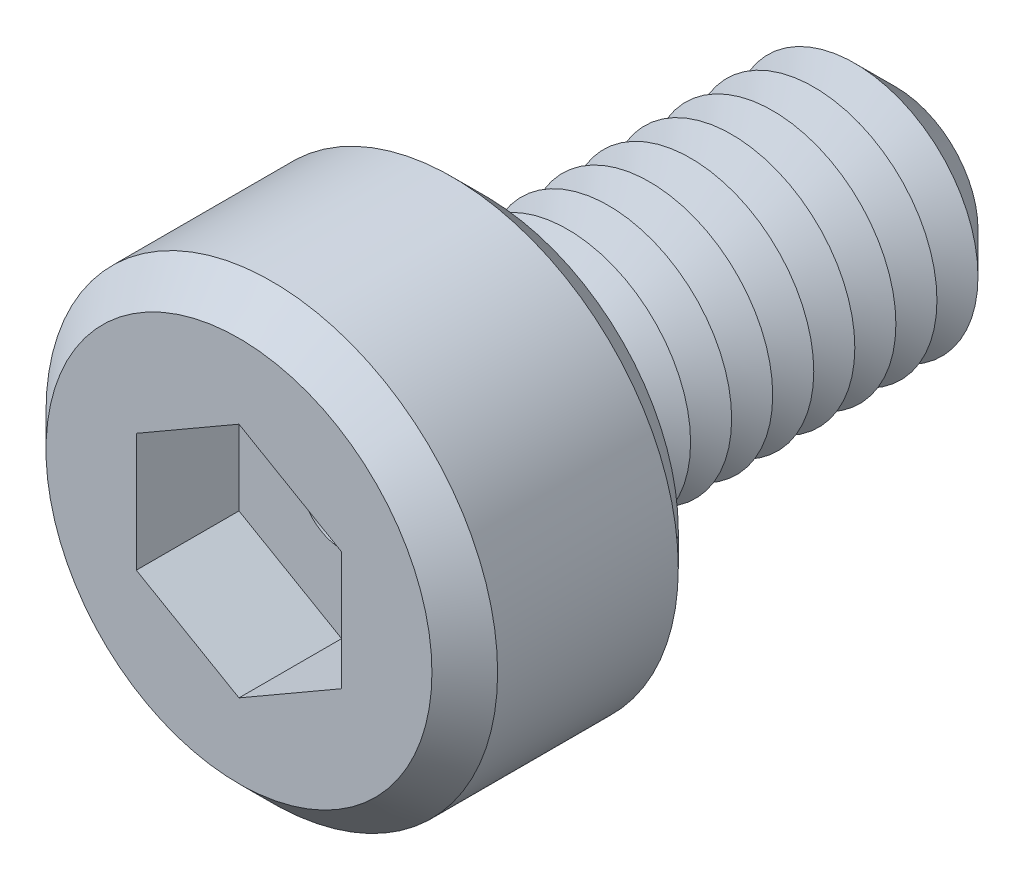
from build123d import *

# Parameters (mm, degrees)
SKETCH1_R           = 2.75
BOSS_EXTRUDE1_DEPTH = 3
SKETCH2_R           = 1.5
BOSS_EXTRUDE2_DEPTH = 5
CHAMFER1_SIZE       = 0.5
LPATTERN1_COUNT     = 9
LPATTERN1_PITCH     = 0.5
CUT_EXTRUDE1_DEPTH  = 1.25
SKETCH6_R           = 0.5
CUT_EXTRUDE2_DEPTH  = 6.75
CHAMFER2_SIZE       = 0.4


with BuildPart() as part:
    # Sketch1 → Boss-Extrude1 (new body)
    with BuildSketch(Plane.XY):
        Circle(SKETCH1_R)
    extrude(amount=BOSS_EXTRUDE1_DEPTH)

    # Sketch2 → Boss-Extrude2 (add)
    with BuildSketch(Plane(origin=(0, 0, 0), x_dir=(-1, 0, 0), z_dir=(0, 0, -1))):
        Circle(SKETCH2_R)
    extrude(amount=BOSS_EXTRUDE2_DEPTH)

    # Chamfer1
    chamfer1_edges = [part.edges().sort_by_distance(p)[0] for p in [
        (1.5, 0, -5),
    ]]
    chamfer(chamfer1_edges, length=CHAMFER1_SIZE)

    # Sketch4 → Cut-Revolve1 (revolve, cut)
    with BuildSketch(Plane(origin=(0, 0, 0), x_dir=(0, 0, -1), z_dir=(1, 0, 0)), mode=Mode.PRIVATE) as cut_revolve1_sk:
        Polygon((0, 1.5), (0.25, 1.066987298), (0.5, 1.5), align=None)
    cut_revolve1 = revolve(cut_revolve1_sk.sketch.rotate(Axis((0, 0, 2.512122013), (0, 0, -1)), 90), axis=Axis((0, 0, 2.512122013), (0, 0, -1)), mode=Mode.SUBTRACT)

    # LPattern1: Cut-Revolve1 ×9
    with Locations(*[(0, 0, -i * LPATTERN1_PITCH) for i in range(1, LPATTERN1_COUNT)]):
        add(cut_revolve1, mode=Mode.SUBTRACT)

    # Sketch5 → Cut-Extrude1 (cut)
    with BuildSketch(Plane.XY.offset(3)):
        Polygon((0, 1.443375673), (-1.25, 0.721687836), (-1.25, -0.721687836), (0, -1.443375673), (1.25, -0.721687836), (1.25, 0.721687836), align=None)
    extrude(amount=-CUT_EXTRUDE1_DEPTH, mode=Mode.SUBTRACT)

    # Sketch6 → Cut-Extrude2 (cut)
    with BuildSketch(Plane.XY.offset(1.75)):
        Circle(SKETCH6_R)
    extrude(amount=-CUT_EXTRUDE2_DEPTH, mode=Mode.SUBTRACT)

    # Chamfer2
    chamfer2_edges = [part.edges().sort_by_distance(p)[0] for p in [
        (-2.75, 0, 0),
        (-2.75, 0, 3),
    ]]
    chamfer(chamfer2_edges, length=CHAMFER2_SIZE)


solid = part.part
